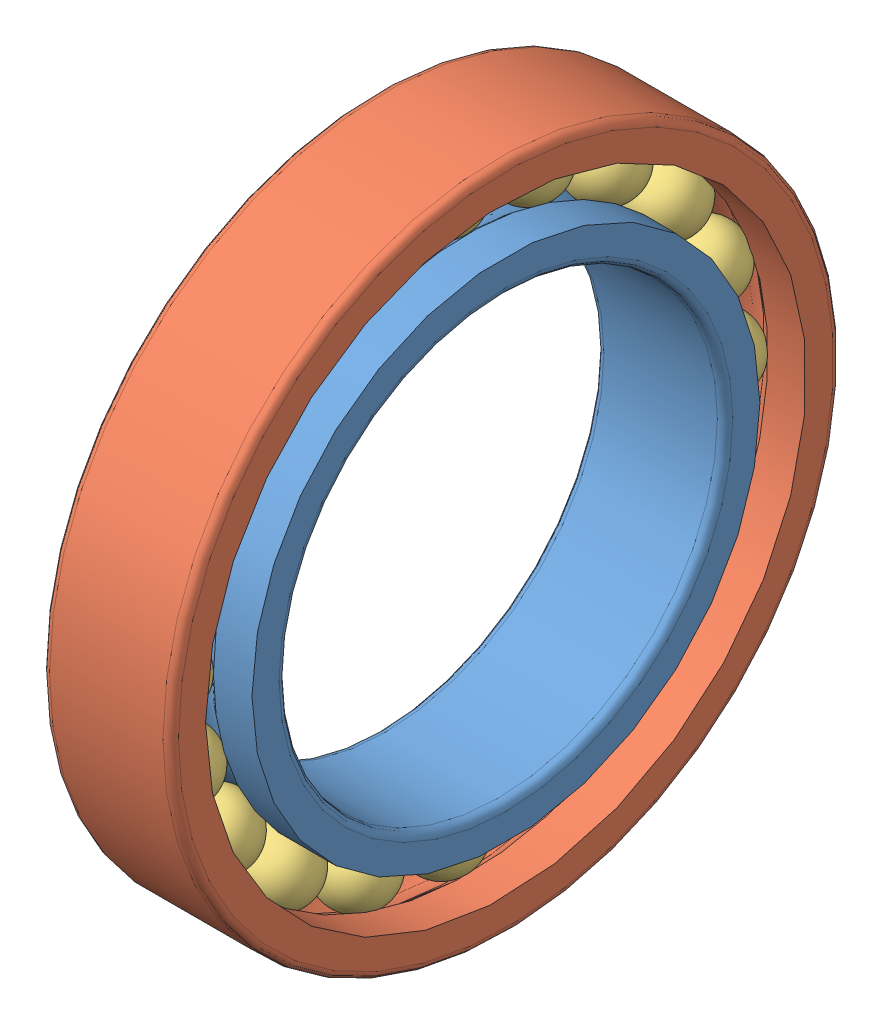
SolidWorks assembly Roulement_r1rb36.SLDASM, configuration Défaut (file format 11000). Lengths in mm.
Overall size (5 26 26).
22 component instances, 3 part files, 4 mates.
Components (placement in the parent):
- Roulement_r1rb_Bint36-1: Roulement_r1rb_Bint36.SLDPRT [Défaut] at origin size (5 19.7 19.7)
- Roulement_r1rb_Bext36-1: Roulement_r1rb_Bext36.SLDPRT [Défaut] at origin size (5 26 26)
- Roulement_r1rb_Eroul36-1: Roulement_r1rb_Eroul36.SLDPRT [Défaut] at (0.3 0 -8.8) size (2.7 2.7 2.7)
- Roulement_r1rb_Eroul36-2: Roulement_r1rb_Eroul36.SLDPRT [Défaut] at (0.3 2.7193 -8.3693) x (1 0 0) z (0 -0.309017 0.951057) size (2.7 2.7 2.7)
- Roulement_r1rb_Eroul36-3: Roulement_r1rb_Eroul36.SLDPRT [Défaut] at (0.3 5.1725 -7.1193) x (1 0 0) z (0 -0.587785 0.809017) size (2.7 2.7 2.7)
- Roulement_r1rb_Eroul36-4: Roulement_r1rb_Eroul36.SLDPRT [Défaut] at (0.3 7.1193 -5.1725) x (1 0 0) z (0 -0.809017 0.587785) size (2.7 2.7 2.7)
- Roulement_r1rb_Eroul36-5: Roulement_r1rb_Eroul36.SLDPRT [Défaut] at (0.3 8.3693 -2.7193) x (1 0 0) z (0 -0.951057 0.309017) size (2.7 2.7 2.7)
- Roulement_r1rb_Eroul36-6: Roulement_r1rb_Eroul36.SLDPRT [Défaut] at (0.3 8.8 0) x (1 0 0) z (0 -1 0) size (2.7 2.7 2.7)
- Roulement_r1rb_Eroul36-7: Roulement_r1rb_Eroul36.SLDPRT [Défaut] at (0.3 8.3693 2.7193) x (1 0 0) z (0 -0.951057 -0.309017) size (2.7 2.7 2.7)
- Roulement_r1rb_Eroul36-8: Roulement_r1rb_Eroul36.SLDPRT [Défaut] at (0.3 7.1193 5.1725) x (1 0 0) z (0 -0.809017 -0.587785) size (2.7 2.7 2.7)
- Roulement_r1rb_Eroul36-9: Roulement_r1rb_Eroul36.SLDPRT [Défaut] at (0.3 5.1725 7.1193) x (1 0 0) z (0 -0.587785 -0.809017) size (2.7 2.7 2.7)
- Roulement_r1rb_Eroul36-10: Roulement_r1rb_Eroul36.SLDPRT [Défaut] at (0.3 2.7193 8.3693) x (1 0 0) z (0 -0.309017 -0.951057) size (2.7 2.7 2.7)
- Roulement_r1rb_Eroul36-11: Roulement_r1rb_Eroul36.SLDPRT [Défaut] at (0.3 0 8.8) x (1 0 0) z (0 0 -1) size (2.7 2.7 2.7)
- Roulement_r1rb_Eroul36-12: Roulement_r1rb_Eroul36.SLDPRT [Défaut] at (0.3 -2.7193 8.3693) x (1 0 0) z (0 0.309017 -0.951057) size (2.7 2.7 2.7)
- Roulement_r1rb_Eroul36-13: Roulement_r1rb_Eroul36.SLDPRT [Défaut] at (0.3 -5.1725 7.1193) x (1 0 0) z (0 0.587785 -0.809017) size (2.7 2.7 2.7)
- Roulement_r1rb_Eroul36-14: Roulement_r1rb_Eroul36.SLDPRT [Défaut] at (0.3 -7.1193 5.1725) x (1 0 0) z (0 0.809017 -0.587785) size (2.7 2.7 2.7)
- Roulement_r1rb_Eroul36-15: Roulement_r1rb_Eroul36.SLDPRT [Défaut] at (0.3 -8.3693 2.7193) x (1 0 0) z (0 0.951057 -0.309017) size (2.7 2.7 2.7)
- Roulement_r1rb_Eroul36-16: Roulement_r1rb_Eroul36.SLDPRT [Défaut] at (0.3 -8.8 0) x (1 0 0) z (0 1 0) size (2.7 2.7 2.7)
- Roulement_r1rb_Eroul36-17: Roulement_r1rb_Eroul36.SLDPRT [Défaut] at (0.3 -8.3693 -2.7193) x (1 0 0) z (0 0.951057 0.309017) size (2.7 2.7 2.7)
- Roulement_r1rb_Eroul36-18: Roulement_r1rb_Eroul36.SLDPRT [Défaut] at (0.3 -7.1193 -5.1725) x (1 0 0) z (0 0.809017 0.587785) size (2.7 2.7 2.7)
- Roulement_r1rb_Eroul36-19: Roulement_r1rb_Eroul36.SLDPRT [Défaut] at (0.3 -5.1725 -7.1193) x (1 0 0) z (0 0.587785 0.809017) size (2.7 2.7 2.7)
- Roulement_r1rb_Eroul36-20: Roulement_r1rb_Eroul36.SLDPRT [Défaut] at (0.3 -2.7193 -8.3693) x (1 0 0) z (0 0.309017 0.951057) size (2.7 2.7 2.7)
Mates (geometry in assembly coordinates):
- Coïncidente1: coincident: point of ?
- Coïncidente2: coincident: unknown of ?
- Coïncidente4: coincident: point of Roulement_r1rb_Eroul36-1; point of assembly
- Parallèle1: parallel: plane of Roulement_r1rb_Bint36-1 through (0 0 0) normal (1 0 0); plane of Roulement_r1rb_Bext36-1 through (0 0 0) normal (1 0 0)
